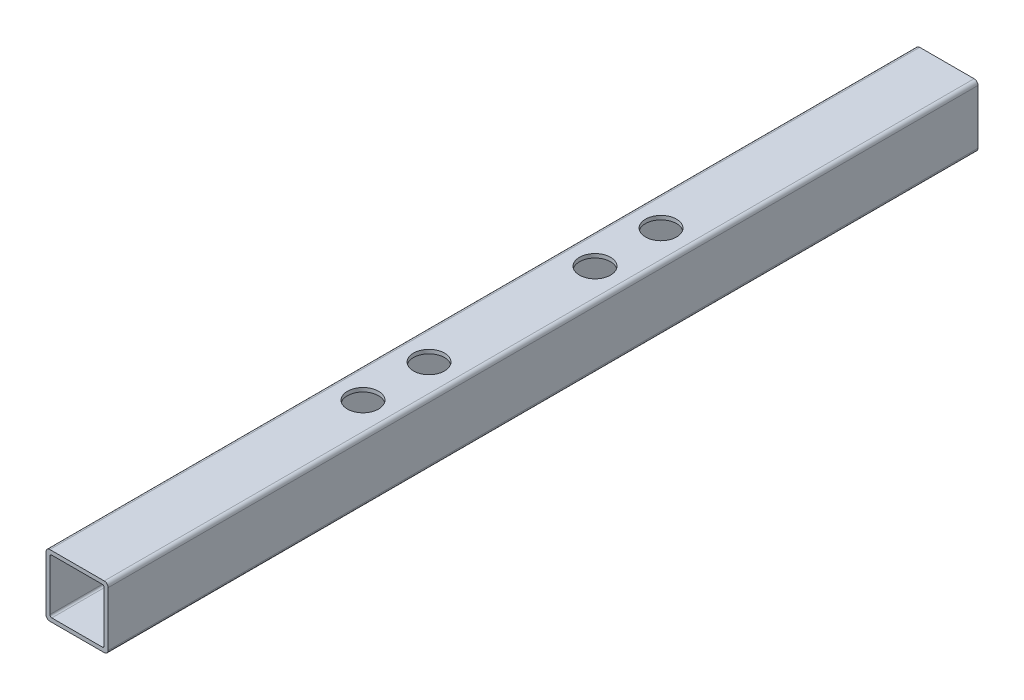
ISO-10303-21;
HEADER;
FILE_DESCRIPTION(('STEP AP214'),'2;1');
FILE_NAME('part.step','',(''),(''),'','','');
FILE_SCHEMA(('AUTOMOTIVE_DESIGN { 1 0 10303 214 1 1 1 1 }'));
ENDSEC;
DATA;
#1=APPLICATION_CONTEXT('core data for automotive mechanical design processes');
#2=APPLICATION_PROTOCOL_DEFINITION('international standard','automotive_design',2000,#1);
#3=PRODUCT_CONTEXT('',#1,'mechanical');
#4=PRODUCT('Part','Part','',(#3));
#5=PRODUCT_RELATED_PRODUCT_CATEGORY('part','',(#4));
#6=PRODUCT_DEFINITION_FORMATION('','',#4);
#7=PRODUCT_DEFINITION_CONTEXT('part definition',#1,'design');
#8=PRODUCT_DEFINITION('design','',#6,#7);
#9=PRODUCT_DEFINITION_SHAPE('','',#8);
#10=(LENGTH_UNIT() NAMED_UNIT(*) SI_UNIT(.MILLI.,.METRE.));
#11=(NAMED_UNIT(*) PLANE_ANGLE_UNIT() SI_UNIT($,.RADIAN.));
#12=(NAMED_UNIT(*) SI_UNIT($,.STERADIAN.) SOLID_ANGLE_UNIT());
#13=UNCERTAINTY_MEASURE_WITH_UNIT(LENGTH_MEASURE(1.E-05),#10,'distance_accuracy_value','');
#14=(GEOMETRIC_REPRESENTATION_CONTEXT(3) GLOBAL_UNCERTAINTY_ASSIGNED_CONTEXT((#13)) GLOBAL_UNIT_ASSIGNED_CONTEXT((#10,
#11,#12)) REPRESENTATION_CONTEXT('',''));
#15=CARTESIAN_POINT('',(0.,0.,0.));
#16=DIRECTION('',(0.,0.,1.));
#17=DIRECTION('',(1.,0.,0.));
#18=AXIS2_PLACEMENT_3D('',#15,#16,#17);
#19=CARTESIAN_POINT('',(-22.225,-22.225,355.6));
#20=DIRECTION('',(0.,0.,1.));
#21=DIRECTION('',(1.,0.,0.));
#22=AXIS2_PLACEMENT_3D('',#19,#20,#21);
#23=PLANE('',#22);
#24=CARTESIAN_POINT('',(-22.225,-22.225,355.6));
#25=DIRECTION('',(0.,0.,1.));
#26=DIRECTION('',(1.,0.,0.));
#27=AXIS2_PLACEMENT_3D('',#24,#25,#26);
#28=CIRCLE('',#27,3.175);
#29=CARTESIAN_POINT('',(-25.4,-22.225,355.6));
#30=VERTEX_POINT('',#29);
#31=CARTESIAN_POINT('',(-22.225,-25.4,355.6));
#32=VERTEX_POINT('',#31);
#33=EDGE_CURVE('E215',#30,#32,#28,.T.);
#34=ORIENTED_EDGE('',*,*,#33,.T.);
#35=DIRECTION('',(1.,0.,0.));
#36=VECTOR('',#35,1.);
#37=CARTESIAN_POINT('',(-22.225,-25.4,355.6));
#38=LINE('',#37,#36);
#39=CARTESIAN_POINT('',(22.225,-25.4,355.6));
#40=VERTEX_POINT('',#39);
#41=EDGE_CURVE('E218',#32,#40,#38,.T.);
#42=ORIENTED_EDGE('',*,*,#41,.T.);
#43=CARTESIAN_POINT('',(22.225,-22.225,355.6));
#44=DIRECTION('',(0.,0.,1.));
#45=DIRECTION('',(1.,0.,0.));
#46=AXIS2_PLACEMENT_3D('',#43,#44,#45);
#47=CIRCLE('',#46,3.175);
#48=CARTESIAN_POINT('',(25.4,-22.225,355.6));
#49=VERTEX_POINT('',#48);
#50=EDGE_CURVE('E221',#40,#49,#47,.T.);
#51=ORIENTED_EDGE('',*,*,#50,.T.);
#52=DIRECTION('',(0.,1.,0.));
#53=VECTOR('',#52,1.);
#54=CARTESIAN_POINT('',(25.4,22.225,355.6));
#55=LINE('',#54,#53);
#56=CARTESIAN_POINT('',(25.4,22.225,355.6));
#57=VERTEX_POINT('',#56);
#58=EDGE_CURVE('E223',#49,#57,#55,.T.);
#59=ORIENTED_EDGE('',*,*,#58,.T.);
#60=CARTESIAN_POINT('',(22.225,22.225,355.6));
#61=DIRECTION('',(0.,0.,1.));
#62=DIRECTION('',(-1.,0.,0.));
#63=AXIS2_PLACEMENT_3D('',#60,#61,#62);
#64=CIRCLE('',#63,3.175);
#65=CARTESIAN_POINT('',(22.225,25.4,355.6));
#66=VERTEX_POINT('',#65);
#67=EDGE_CURVE('E225',#57,#66,#64,.T.);
#68=ORIENTED_EDGE('',*,*,#67,.T.);
#69=DIRECTION('',(-1.,0.,0.));
#70=VECTOR('',#69,1.);
#71=CARTESIAN_POINT('',(-22.225,25.4,355.6));
#72=LINE('',#71,#70);
#73=CARTESIAN_POINT('',(-22.225,25.4,355.6));
#74=VERTEX_POINT('',#73);
#75=EDGE_CURVE('E227',#66,#74,#72,.T.);
#76=ORIENTED_EDGE('',*,*,#75,.T.);
#77=CARTESIAN_POINT('',(-22.225,22.225,355.6));
#78=DIRECTION('',(0.,0.,1.));
#79=DIRECTION('',(1.,0.,0.));
#80=AXIS2_PLACEMENT_3D('',#77,#78,#79);
#81=CIRCLE('',#80,3.175);
#82=CARTESIAN_POINT('',(-25.4,22.225,355.6));
#83=VERTEX_POINT('',#82);
#84=EDGE_CURVE('E229',#74,#83,#81,.T.);
#85=ORIENTED_EDGE('',*,*,#84,.T.);
#86=DIRECTION('',(0.,-1.,0.));
#87=VECTOR('',#86,1.);
#88=CARTESIAN_POINT('',(-25.4,22.225,355.6));
#89=LINE('',#88,#87);
#90=EDGE_CURVE('E231',#83,#30,#89,.T.);
#91=ORIENTED_EDGE('',*,*,#90,.T.);
#92=EDGE_LOOP('',(#34,#42,#51,#59,#68,#76,#85,#91));
#93=FACE_BOUND('',#92,.T.);
#94=DIRECTION('',(0.,-1.,0.));
#95=VECTOR('',#94,1.);
#96=CARTESIAN_POINT('',(-22.225,20.6375,355.6));
#97=LINE('',#96,#95);
#98=CARTESIAN_POINT('',(-22.225,20.6375,355.6));
#99=VERTEX_POINT('',#98);
#100=CARTESIAN_POINT('',(-22.225,-20.6375,355.6));
#101=VERTEX_POINT('',#100);
#102=EDGE_CURVE('E156',#99,#101,#97,.T.);
#103=ORIENTED_EDGE('',*,*,#102,.F.);
#104=CARTESIAN_POINT('',(-20.6375,20.6375,355.6));
#105=DIRECTION('',(0.,0.,1.));
#106=DIRECTION('',(1.,0.,0.));
#107=AXIS2_PLACEMENT_3D('',#104,#105,#106);
#108=CIRCLE('',#107,1.5875);
#109=CARTESIAN_POINT('',(-20.6375,22.225,355.6));
#110=VERTEX_POINT('',#109);
#111=EDGE_CURVE('E148',#110,#99,#108,.T.);
#112=ORIENTED_EDGE('',*,*,#111,.F.);
#113=DIRECTION('',(-1.,0.,0.));
#114=VECTOR('',#113,1.);
#115=CARTESIAN_POINT('',(-20.6375,22.225,355.6));
#116=LINE('',#115,#114);
#117=CARTESIAN_POINT('',(20.6375,22.225,355.6));
#118=VERTEX_POINT('',#117);
#119=EDGE_CURVE('E182',#118,#110,#116,.T.);
#120=ORIENTED_EDGE('',*,*,#119,.F.);
#121=CARTESIAN_POINT('',(20.6375,20.6375,355.6));
#122=DIRECTION('',(0.,0.,1.));
#123=DIRECTION('',(-1.,0.,0.));
#124=AXIS2_PLACEMENT_3D('',#121,#122,#123);
#125=CIRCLE('',#124,1.5875);
#126=CARTESIAN_POINT('',(22.225,20.6375,355.6));
#127=VERTEX_POINT('',#126);
#128=EDGE_CURVE('E180',#127,#118,#125,.T.);
#129=ORIENTED_EDGE('',*,*,#128,.F.);
#130=DIRECTION('',(0.,1.,0.));
#131=VECTOR('',#130,1.);
#132=CARTESIAN_POINT('',(22.225,20.6375,355.6));
#133=LINE('',#132,#131);
#134=CARTESIAN_POINT('',(22.225,-20.6375,355.6));
#135=VERTEX_POINT('',#134);
#136=EDGE_CURVE('E178',#135,#127,#133,.T.);
#137=ORIENTED_EDGE('',*,*,#136,.F.);
#138=CARTESIAN_POINT('',(20.6375,-20.6375,355.6));
#139=DIRECTION('',(0.,0.,1.));
#140=DIRECTION('',(1.,0.,0.));
#141=AXIS2_PLACEMENT_3D('',#138,#139,#140);
#142=CIRCLE('',#141,1.5875);
#143=CARTESIAN_POINT('',(20.6375,-22.225,355.6));
#144=VERTEX_POINT('',#143);
#145=EDGE_CURVE('E176',#144,#135,#142,.T.);
#146=ORIENTED_EDGE('',*,*,#145,.F.);
#147=DIRECTION('',(1.,0.,0.));
#148=VECTOR('',#147,1.);
#149=CARTESIAN_POINT('',(-20.6375,-22.225,355.6));
#150=LINE('',#149,#148);
#151=CARTESIAN_POINT('',(-20.6375,-22.225,355.6));
#152=VERTEX_POINT('',#151);
#153=EDGE_CURVE('E171',#152,#144,#150,.T.);
#154=ORIENTED_EDGE('',*,*,#153,.F.);
#155=CARTESIAN_POINT('',(-20.6375,-20.6375,355.6));
#156=DIRECTION('',(0.,0.,1.));
#157=DIRECTION('',(1.,0.,0.));
#158=AXIS2_PLACEMENT_3D('',#155,#156,#157);
#159=CIRCLE('',#158,1.5875);
#160=EDGE_CURVE('E169',#101,#152,#159,.T.);
#161=ORIENTED_EDGE('',*,*,#160,.F.);
#162=EDGE_LOOP('',(#103,#112,#120,#129,#137,#146,#154,#161));
#163=FACE_BOUND('',#162,.T.);
#164=ADVANCED_FACE('F33',(#93,#163),#23,.T.);
#165=CARTESIAN_POINT('',(-22.225,-22.225,-355.6));
#166=DIRECTION('',(0.,0.,1.));
#167=DIRECTION('',(1.,0.,0.));
#168=AXIS2_PLACEMENT_3D('',#165,#166,#167);
#169=PLANE('',#168);
#170=CARTESIAN_POINT('',(-22.225,-22.225,-355.6));
#171=DIRECTION('',(0.,0.,1.));
#172=DIRECTION('',(1.,0.,0.));
#173=AXIS2_PLACEMENT_3D('',#170,#171,#172);
#174=CIRCLE('',#173,3.175);
#175=CARTESIAN_POINT('',(-25.4,-22.225,-355.6));
#176=VERTEX_POINT('',#175);
#177=CARTESIAN_POINT('',(-22.225,-25.4,-355.6));
#178=VERTEX_POINT('',#177);
#179=EDGE_CURVE('E164',#176,#178,#174,.T.);
#180=ORIENTED_EDGE('',*,*,#179,.F.);
#181=DIRECTION('',(0.,-1.,0.));
#182=VECTOR('',#181,1.);
#183=CARTESIAN_POINT('',(-25.4,22.225,-355.6));
#184=LINE('',#183,#182);
#185=CARTESIAN_POINT('',(-25.4,22.225,-355.6));
#186=VERTEX_POINT('',#185);
#187=EDGE_CURVE('E219',#186,#176,#184,.T.);
#188=ORIENTED_EDGE('',*,*,#187,.F.);
#189=CARTESIAN_POINT('',(-22.225,22.225,-355.6));
#190=DIRECTION('',(0.,0.,1.));
#191=DIRECTION('',(1.,0.,0.));
#192=AXIS2_PLACEMENT_3D('',#189,#190,#191);
#193=CIRCLE('',#192,3.175);
#194=CARTESIAN_POINT('',(-22.225,25.4,-355.6));
#195=VERTEX_POINT('',#194);
#196=EDGE_CURVE('E246',#195,#186,#193,.T.);
#197=ORIENTED_EDGE('',*,*,#196,.F.);
#198=DIRECTION('',(-1.,0.,0.));
#199=VECTOR('',#198,1.);
#200=CARTESIAN_POINT('',(-22.225,25.4,-355.6));
#201=LINE('',#200,#199);
#202=CARTESIAN_POINT('',(22.225,25.4,-355.6));
#203=VERTEX_POINT('',#202);
#204=EDGE_CURVE('E244',#203,#195,#201,.T.);
#205=ORIENTED_EDGE('',*,*,#204,.F.);
#206=CARTESIAN_POINT('',(22.225,22.225,-355.6));
#207=DIRECTION('',(0.,0.,1.));
#208=DIRECTION('',(-1.,0.,0.));
#209=AXIS2_PLACEMENT_3D('',#206,#207,#208);
#210=CIRCLE('',#209,3.175);
#211=CARTESIAN_POINT('',(25.4,22.225,-355.6));
#212=VERTEX_POINT('',#211);
#213=EDGE_CURVE('E242',#212,#203,#210,.T.);
#214=ORIENTED_EDGE('',*,*,#213,.F.);
#215=DIRECTION('',(0.,1.,0.));
#216=VECTOR('',#215,1.);
#217=CARTESIAN_POINT('',(25.4,22.225,-355.6));
#218=LINE('',#217,#216);
#219=CARTESIAN_POINT('',(25.4,-22.225,-355.6));
#220=VERTEX_POINT('',#219);
#221=EDGE_CURVE('E240',#220,#212,#218,.T.);
#222=ORIENTED_EDGE('',*,*,#221,.F.);
#223=CARTESIAN_POINT('',(22.225,-22.225,-355.6));
#224=DIRECTION('',(0.,0.,1.));
#225=DIRECTION('',(1.,0.,0.));
#226=AXIS2_PLACEMENT_3D('',#223,#224,#225);
#227=CIRCLE('',#226,3.175);
#228=CARTESIAN_POINT('',(22.225,-25.4,-355.6));
#229=VERTEX_POINT('',#228);
#230=EDGE_CURVE('E238',#229,#220,#227,.T.);
#231=ORIENTED_EDGE('',*,*,#230,.F.);
#232=DIRECTION('',(1.,0.,0.));
#233=VECTOR('',#232,1.);
#234=CARTESIAN_POINT('',(-22.225,-25.4,-355.6));
#235=LINE('',#234,#233);
#236=EDGE_CURVE('E236',#178,#229,#235,.T.);
#237=ORIENTED_EDGE('',*,*,#236,.F.);
#238=EDGE_LOOP('',(#180,#188,#197,#205,#214,#222,#231,#237));
#239=FACE_BOUND('',#238,.T.);
#240=CARTESIAN_POINT('',(-20.6375,20.6375,-355.6));
#241=DIRECTION('',(0.,0.,1.));
#242=DIRECTION('',(1.,0.,0.));
#243=AXIS2_PLACEMENT_3D('',#240,#241,#242);
#244=CIRCLE('',#243,1.5875);
#245=CARTESIAN_POINT('',(-20.6375,22.225,-355.6));
#246=VERTEX_POINT('',#245);
#247=CARTESIAN_POINT('',(-22.225,20.6375,-355.6));
#248=VERTEX_POINT('',#247);
#249=EDGE_CURVE('E58',#246,#248,#244,.T.);
#250=ORIENTED_EDGE('',*,*,#249,.T.);
#251=DIRECTION('',(0.,-1.,0.));
#252=VECTOR('',#251,1.);
#253=CARTESIAN_POINT('',(-22.225,20.6375,-355.6));
#254=LINE('',#253,#252);
#255=CARTESIAN_POINT('',(-22.225,-20.6375,-355.6));
#256=VERTEX_POINT('',#255);
#257=EDGE_CURVE('E163',#248,#256,#254,.T.);
#258=ORIENTED_EDGE('',*,*,#257,.T.);
#259=CARTESIAN_POINT('',(-20.6375,-20.6375,-355.6));
#260=DIRECTION('',(0.,0.,1.));
#261=DIRECTION('',(1.,0.,0.));
#262=AXIS2_PLACEMENT_3D('',#259,#260,#261);
#263=CIRCLE('',#262,1.5875);
#264=CARTESIAN_POINT('',(-20.6375,-22.225,-355.6));
#265=VERTEX_POINT('',#264);
#266=EDGE_CURVE('E187',#256,#265,#263,.T.);
#267=ORIENTED_EDGE('',*,*,#266,.T.);
#268=DIRECTION('',(1.,0.,0.));
#269=VECTOR('',#268,1.);
#270=CARTESIAN_POINT('',(-20.6375,-22.225,-355.6));
#271=LINE('',#270,#269);
#272=CARTESIAN_POINT('',(20.6375,-22.225,-355.6));
#273=VERTEX_POINT('',#272);
#274=EDGE_CURVE('E190',#265,#273,#271,.T.);
#275=ORIENTED_EDGE('',*,*,#274,.T.);
#276=CARTESIAN_POINT('',(20.6375,-20.6375,-355.6));
#277=DIRECTION('',(0.,0.,1.));
#278=DIRECTION('',(1.,0.,0.));
#279=AXIS2_PLACEMENT_3D('',#276,#277,#278);
#280=CIRCLE('',#279,1.5875);
#281=CARTESIAN_POINT('',(22.225,-20.6375,-355.6));
#282=VERTEX_POINT('',#281);
#283=EDGE_CURVE('E193',#273,#282,#280,.T.);
#284=ORIENTED_EDGE('',*,*,#283,.T.);
#285=DIRECTION('',(0.,1.,0.));
#286=VECTOR('',#285,1.);
#287=CARTESIAN_POINT('',(22.225,20.6375,-355.6));
#288=LINE('',#287,#286);
#289=CARTESIAN_POINT('',(22.225,20.6375,-355.6));
#290=VERTEX_POINT('',#289);
#291=EDGE_CURVE('E196',#282,#290,#288,.T.);
#292=ORIENTED_EDGE('',*,*,#291,.T.);
#293=CARTESIAN_POINT('',(20.6375,20.6375,-355.6));
#294=DIRECTION('',(0.,0.,1.));
#295=DIRECTION('',(-1.,0.,0.));
#296=AXIS2_PLACEMENT_3D('',#293,#294,#295);
#297=CIRCLE('',#296,1.5875);
#298=CARTESIAN_POINT('',(20.6375,22.225,-355.6));
#299=VERTEX_POINT('',#298);
#300=EDGE_CURVE('E199',#290,#299,#297,.T.);
#301=ORIENTED_EDGE('',*,*,#300,.T.);
#302=DIRECTION('',(-1.,0.,0.));
#303=VECTOR('',#302,1.);
#304=CARTESIAN_POINT('',(-20.6375,22.225,-355.6));
#305=LINE('',#304,#303);
#306=EDGE_CURVE('E157',#299,#246,#305,.T.);
#307=ORIENTED_EDGE('',*,*,#306,.T.);
#308=EDGE_LOOP('',(#250,#258,#267,#275,#284,#292,#301,#307));
#309=FACE_BOUND('',#308,.T.);
#310=ADVANCED_FACE('F324',(#239,#309),#169,.F.);
#311=CARTESIAN_POINT('',(-22.225,-22.225,355.6));
#312=DIRECTION('',(0.,0.,-1.));
#313=DIRECTION('',(-1.,0.,0.));
#314=AXIS2_PLACEMENT_3D('',#311,#312,#313);
#315=CYLINDRICAL_SURFACE('',#314,3.175);
#316=ORIENTED_EDGE('',*,*,#179,.T.);
#317=DIRECTION('',(0.,0.,-1.));
#318=VECTOR('',#317,1.);
#319=CARTESIAN_POINT('',(-22.225,-25.4,355.6));
#320=LINE('',#319,#318);
#321=EDGE_CURVE('E11',#32,#178,#320,.T.);
#322=ORIENTED_EDGE('',*,*,#321,.F.);
#323=ORIENTED_EDGE('',*,*,#33,.F.);
#324=DIRECTION('',(0.,0.,-1.));
#325=VECTOR('',#324,1.);
#326=CARTESIAN_POINT('',(-25.4,-22.225,355.6));
#327=LINE('',#326,#325);
#328=EDGE_CURVE('E233',#30,#176,#327,.T.);
#329=ORIENTED_EDGE('',*,*,#328,.T.);
#330=EDGE_LOOP('',(#316,#322,#323,#329));
#331=FACE_BOUND('',#330,.T.);
#332=ADVANCED_FACE('F35',(#331),#315,.T.);
#333=CARTESIAN_POINT('',(-22.225,-25.4,355.6));
#334=DIRECTION('',(0.,1.,0.));
#335=DIRECTION('',(0.,0.,1.));
#336=AXIS2_PLACEMENT_3D('',#333,#334,#335);
#337=PLANE('',#336);
#338=CARTESIAN_POINT('',(0.,-25.4,121.840625));
#339=DIRECTION('',(0.,1.,0.));
#340=DIRECTION('',(0.,0.,1.));
#341=AXIS2_PLACEMENT_3D('',#338,#339,#340);
#342=CIRCLE('',#341,12.7);
#343=CARTESIAN_POINT('',(0.,-25.4,134.540625));
#344=VERTEX_POINT('',#343);
#345=EDGE_CURVE('E374',#344,#344,#342,.T.);
#346=ORIENTED_EDGE('',*,*,#345,.T.);
#347=EDGE_LOOP('',(#346));
#348=FACE_BOUND('',#347,.T.);
#349=CARTESIAN_POINT('',(0.,-25.4,67.865625));
#350=DIRECTION('',(0.,1.,0.));
#351=DIRECTION('',(0.,0.,1.));
#352=AXIS2_PLACEMENT_3D('',#349,#350,#351);
#353=CIRCLE('',#352,12.7);
#354=CARTESIAN_POINT('',(0.,-25.4,80.565625));
#355=VERTEX_POINT('',#354);
#356=EDGE_CURVE('E279',#355,#355,#353,.T.);
#357=ORIENTED_EDGE('',*,*,#356,.T.);
#358=EDGE_LOOP('',(#357));
#359=FACE_BOUND('',#358,.T.);
#360=CARTESIAN_POINT('',(0.,-25.4,-67.865625));
#361=DIRECTION('',(0.,1.,0.));
#362=DIRECTION('',(0.,0.,1.));
#363=AXIS2_PLACEMENT_3D('',#360,#361,#362);
#364=CIRCLE('',#363,12.7);
#365=CARTESIAN_POINT('',(0.,-25.4,-55.165625));
#366=VERTEX_POINT('',#365);
#367=EDGE_CURVE('E275',#366,#366,#364,.T.);
#368=ORIENTED_EDGE('',*,*,#367,.T.);
#369=EDGE_LOOP('',(#368));
#370=FACE_BOUND('',#369,.T.);
#371=CARTESIAN_POINT('',(0.,-25.4,-121.840625));
#372=DIRECTION('',(0.,1.,0.));
#373=DIRECTION('',(0.,0.,1.));
#374=AXIS2_PLACEMENT_3D('',#371,#372,#373);
#375=CIRCLE('',#374,12.7);
#376=CARTESIAN_POINT('',(0.,-25.4,-109.140625));
#377=VERTEX_POINT('',#376);
#378=EDGE_CURVE('E271',#377,#377,#375,.T.);
#379=ORIENTED_EDGE('',*,*,#378,.T.);
#380=EDGE_LOOP('',(#379));
#381=FACE_BOUND('',#380,.T.);
#382=ORIENTED_EDGE('',*,*,#236,.T.);
#383=DIRECTION('',(0.,0.,-1.));
#384=VECTOR('',#383,1.);
#385=CARTESIAN_POINT('',(22.225,-25.4,355.6));
#386=LINE('',#385,#384);
#387=EDGE_CURVE('E42',#40,#229,#386,.T.);
#388=ORIENTED_EDGE('',*,*,#387,.F.);
#389=ORIENTED_EDGE('',*,*,#41,.F.);
#390=ORIENTED_EDGE('',*,*,#321,.T.);
#391=EDGE_LOOP('',(#382,#388,#389,#390));
#392=FACE_BOUND('',#391,.T.);
#393=ADVANCED_FACE('F364',(#348,#359,#370,#381,#392),#337,.F.);
#394=CARTESIAN_POINT('',(22.225,-22.225,355.6));
#395=DIRECTION('',(0.,0.,-1.));
#396=DIRECTION('',(-1.,0.,0.));
#397=AXIS2_PLACEMENT_3D('',#394,#395,#396);
#398=CYLINDRICAL_SURFACE('',#397,3.175);
#399=ORIENTED_EDGE('',*,*,#230,.T.);
#400=DIRECTION('',(0.,0.,-1.));
#401=VECTOR('',#400,1.);
#402=CARTESIAN_POINT('',(25.4,-22.225,355.6));
#403=LINE('',#402,#401);
#404=EDGE_CURVE('E263',#49,#220,#403,.T.);
#405=ORIENTED_EDGE('',*,*,#404,.F.);
#406=ORIENTED_EDGE('',*,*,#50,.F.);
#407=ORIENTED_EDGE('',*,*,#387,.T.);
#408=EDGE_LOOP('',(#399,#405,#406,#407));
#409=FACE_BOUND('',#408,.T.);
#410=ADVANCED_FACE('F361',(#409),#398,.T.);
#411=CARTESIAN_POINT('',(25.4,22.225,355.6));
#412=DIRECTION('',(-1.,0.,0.));
#413=DIRECTION('',(0.,-1.,0.));
#414=AXIS2_PLACEMENT_3D('',#411,#412,#413);
#415=PLANE('',#414);
#416=ORIENTED_EDGE('',*,*,#221,.T.);
#417=DIRECTION('',(0.,0.,-1.));
#418=VECTOR('',#417,1.);
#419=CARTESIAN_POINT('',(25.4,22.225,355.6));
#420=LINE('',#419,#418);
#421=EDGE_CURVE('E260',#57,#212,#420,.T.);
#422=ORIENTED_EDGE('',*,*,#421,.F.);
#423=ORIENTED_EDGE('',*,*,#58,.F.);
#424=ORIENTED_EDGE('',*,*,#404,.T.);
#425=EDGE_LOOP('',(#416,#422,#423,#424));
#426=FACE_BOUND('',#425,.T.);
#427=ADVANCED_FACE('F357',(#426),#415,.F.);
#428=CARTESIAN_POINT('',(22.225,22.225,355.6));
#429=DIRECTION('',(0.,0.,-1.));
#430=DIRECTION('',(-1.,0.,0.));
#431=AXIS2_PLACEMENT_3D('',#428,#429,#430);
#432=CYLINDRICAL_SURFACE('',#431,3.175);
#433=ORIENTED_EDGE('',*,*,#213,.T.);
#434=DIRECTION('',(0.,0.,-1.));
#435=VECTOR('',#434,1.);
#436=CARTESIAN_POINT('',(22.225,25.4,355.6));
#437=LINE('',#436,#435);
#438=EDGE_CURVE('E257',#66,#203,#437,.T.);
#439=ORIENTED_EDGE('',*,*,#438,.F.);
#440=ORIENTED_EDGE('',*,*,#67,.F.);
#441=ORIENTED_EDGE('',*,*,#421,.T.);
#442=EDGE_LOOP('',(#433,#439,#440,#441));
#443=FACE_BOUND('',#442,.T.);
#444=ADVANCED_FACE('F353',(#443),#432,.T.);
#445=CARTESIAN_POINT('',(-22.225,25.4,355.6));
#446=DIRECTION('',(0.,-1.,0.));
#447=DIRECTION('',(0.,0.,-1.));
#448=AXIS2_PLACEMENT_3D('',#445,#446,#447);
#449=PLANE('',#448);
#450=CARTESIAN_POINT('',(0.,25.4,121.840625));
#451=DIRECTION('',(0.,1.,0.));
#452=DIRECTION('',(0.,0.,1.));
#453=AXIS2_PLACEMENT_3D('',#450,#451,#452);
#454=CIRCLE('',#453,12.7);
#455=CARTESIAN_POINT('',(0.,25.4,134.540625));
#456=VERTEX_POINT('',#455);
#457=EDGE_CURVE('E519',#456,#456,#454,.T.);
#458=ORIENTED_EDGE('',*,*,#457,.F.);
#459=EDGE_LOOP('',(#458));
#460=FACE_BOUND('',#459,.T.);
#461=CARTESIAN_POINT('',(0.,25.4,67.865625));
#462=DIRECTION('',(0.,1.,0.));
#463=DIRECTION('',(0.,0.,1.));
#464=AXIS2_PLACEMENT_3D('',#461,#462,#463);
#465=CIRCLE('',#464,12.7);
#466=CARTESIAN_POINT('',(0.,25.4,80.565625));
#467=VERTEX_POINT('',#466);
#468=EDGE_CURVE('E286',#467,#467,#465,.T.);
#469=ORIENTED_EDGE('',*,*,#468,.F.);
#470=EDGE_LOOP('',(#469));
#471=FACE_BOUND('',#470,.T.);
#472=CARTESIAN_POINT('',(0.,25.4,-67.865625));
#473=DIRECTION('',(0.,1.,0.));
#474=DIRECTION('',(0.,0.,1.));
#475=AXIS2_PLACEMENT_3D('',#472,#473,#474);
#476=CIRCLE('',#475,12.7);
#477=CARTESIAN_POINT('',(0.,25.4,-55.165625));
#478=VERTEX_POINT('',#477);
#479=EDGE_CURVE('E283',#478,#478,#476,.T.);
#480=ORIENTED_EDGE('',*,*,#479,.F.);
#481=EDGE_LOOP('',(#480));
#482=FACE_BOUND('',#481,.T.);
#483=CARTESIAN_POINT('',(0.,25.4,-121.840625));
#484=DIRECTION('',(0.,1.,0.));
#485=DIRECTION('',(0.,0.,1.));
#486=AXIS2_PLACEMENT_3D('',#483,#484,#485);
#487=CIRCLE('',#486,12.7);
#488=CARTESIAN_POINT('',(0.,25.4,-109.140625));
#489=VERTEX_POINT('',#488);
#490=EDGE_CURVE('E301',#489,#489,#487,.T.);
#491=ORIENTED_EDGE('',*,*,#490,.F.);
#492=EDGE_LOOP('',(#491));
#493=FACE_BOUND('',#492,.T.);
#494=ORIENTED_EDGE('',*,*,#204,.T.);
#495=DIRECTION('',(0.,0.,-1.));
#496=VECTOR('',#495,1.);
#497=CARTESIAN_POINT('',(-22.225,25.4,355.6));
#498=LINE('',#497,#496);
#499=EDGE_CURVE('E254',#74,#195,#498,.T.);
#500=ORIENTED_EDGE('',*,*,#499,.F.);
#501=ORIENTED_EDGE('',*,*,#75,.F.);
#502=ORIENTED_EDGE('',*,*,#438,.T.);
#503=EDGE_LOOP('',(#494,#500,#501,#502));
#504=FACE_BOUND('',#503,.T.);
#505=ADVANCED_FACE('F349',(#460,#471,#482,#493,#504),#449,.F.);
#506=CARTESIAN_POINT('',(-22.225,22.225,355.6));
#507=DIRECTION('',(0.,0.,-1.));
#508=DIRECTION('',(-1.,0.,0.));
#509=AXIS2_PLACEMENT_3D('',#506,#507,#508);
#510=CYLINDRICAL_SURFACE('',#509,3.175);
#511=ORIENTED_EDGE('',*,*,#196,.T.);
#512=DIRECTION('',(0.,0.,-1.));
#513=VECTOR('',#512,1.);
#514=CARTESIAN_POINT('',(-25.4,22.225,355.6));
#515=LINE('',#514,#513);
#516=EDGE_CURVE('E251',#83,#186,#515,.T.);
#517=ORIENTED_EDGE('',*,*,#516,.F.);
#518=ORIENTED_EDGE('',*,*,#84,.F.);
#519=ORIENTED_EDGE('',*,*,#499,.T.);
#520=EDGE_LOOP('',(#511,#517,#518,#519));
#521=FACE_BOUND('',#520,.T.);
#522=ADVANCED_FACE('F345',(#521),#510,.T.);
#523=CARTESIAN_POINT('',(-25.4,22.225,355.6));
#524=DIRECTION('',(1.,0.,0.));
#525=DIRECTION('',(0.,1.,0.));
#526=AXIS2_PLACEMENT_3D('',#523,#524,#525);
#527=PLANE('',#526);
#528=ORIENTED_EDGE('',*,*,#187,.T.);
#529=ORIENTED_EDGE('',*,*,#328,.F.);
#530=ORIENTED_EDGE('',*,*,#90,.F.);
#531=ORIENTED_EDGE('',*,*,#516,.T.);
#532=EDGE_LOOP('',(#528,#529,#530,#531));
#533=FACE_BOUND('',#532,.T.);
#534=ADVANCED_FACE('F342',(#533),#527,.F.);
#535=CARTESIAN_POINT('',(-20.6375,20.6375,355.6));
#536=DIRECTION('',(0.,0.,-1.));
#537=DIRECTION('',(-1.,0.,0.));
#538=AXIS2_PLACEMENT_3D('',#535,#536,#537);
#539=CYLINDRICAL_SURFACE('',#538,1.5875);
#540=ORIENTED_EDGE('',*,*,#249,.F.);
#541=DIRECTION('',(0.,0.,-1.));
#542=VECTOR('',#541,1.);
#543=CARTESIAN_POINT('',(-20.6375,22.225,355.6));
#544=LINE('',#543,#542);
#545=EDGE_CURVE('E152',#110,#246,#544,.T.);
#546=ORIENTED_EDGE('',*,*,#545,.F.);
#547=ORIENTED_EDGE('',*,*,#111,.T.);
#548=DIRECTION('',(0.,0.,-1.));
#549=VECTOR('',#548,1.);
#550=CARTESIAN_POINT('',(-22.225,20.6375,355.6));
#551=LINE('',#550,#549);
#552=EDGE_CURVE('E151',#99,#248,#551,.T.);
#553=ORIENTED_EDGE('',*,*,#552,.T.);
#554=EDGE_LOOP('',(#540,#546,#547,#553));
#555=FACE_BOUND('',#554,.T.);
#556=ADVANCED_FACE('F150',(#555),#539,.F.);
#557=CARTESIAN_POINT('',(-22.225,20.6375,355.6));
#558=DIRECTION('',(1.,0.,0.));
#559=DIRECTION('',(0.,0.,-1.));
#560=AXIS2_PLACEMENT_3D('',#557,#558,#559);
#561=PLANE('',#560);
#562=ORIENTED_EDGE('',*,*,#257,.F.);
#563=ORIENTED_EDGE('',*,*,#552,.F.);
#564=ORIENTED_EDGE('',*,*,#102,.T.);
#565=DIRECTION('',(0.,0.,-1.));
#566=VECTOR('',#565,1.);
#567=CARTESIAN_POINT('',(-22.225,-20.6375,355.6));
#568=LINE('',#567,#566);
#569=EDGE_CURVE('E165',#101,#256,#568,.T.);
#570=ORIENTED_EDGE('',*,*,#569,.T.);
#571=EDGE_LOOP('',(#562,#563,#564,#570));
#572=FACE_BOUND('',#571,.T.);
#573=ADVANCED_FACE('F160',(#572),#561,.T.);
#574=CARTESIAN_POINT('',(-20.6375,-20.6375,355.6));
#575=DIRECTION('',(0.,0.,-1.));
#576=DIRECTION('',(-1.,0.,0.));
#577=AXIS2_PLACEMENT_3D('',#574,#575,#576);
#578=CYLINDRICAL_SURFACE('',#577,1.5875);
#579=ORIENTED_EDGE('',*,*,#266,.F.);
#580=ORIENTED_EDGE('',*,*,#569,.F.);
#581=ORIENTED_EDGE('',*,*,#160,.T.);
#582=DIRECTION('',(0.,0.,-1.));
#583=VECTOR('',#582,1.);
#584=CARTESIAN_POINT('',(-20.6375,-22.225,355.6));
#585=LINE('',#584,#583);
#586=EDGE_CURVE('E212',#152,#265,#585,.T.);
#587=ORIENTED_EDGE('',*,*,#586,.T.);
#588=EDGE_LOOP('',(#579,#580,#581,#587));
#589=FACE_BOUND('',#588,.T.);
#590=ADVANCED_FACE('F315',(#589),#578,.F.);
#591=CARTESIAN_POINT('',(-20.6375,-22.225,355.6));
#592=DIRECTION('',(0.,1.,0.));
#593=DIRECTION('',(0.,0.,1.));
#594=AXIS2_PLACEMENT_3D('',#591,#592,#593);
#595=PLANE('',#594);
#596=CARTESIAN_POINT('',(0.,-22.225,121.840625));
#597=DIRECTION('',(0.,1.,0.));
#598=DIRECTION('',(0.,0.,1.));
#599=AXIS2_PLACEMENT_3D('',#596,#597,#598);
#600=CIRCLE('',#599,12.7);
#601=CARTESIAN_POINT('',(0.,-22.225,134.540625));
#602=VERTEX_POINT('',#601);
#603=EDGE_CURVE('E291',#602,#602,#600,.T.);
#604=ORIENTED_EDGE('',*,*,#603,.F.);
#605=EDGE_LOOP('',(#604));
#606=FACE_BOUND('',#605,.T.);
#607=CARTESIAN_POINT('',(0.,-22.225,67.865625));
#608=DIRECTION('',(0.,1.,0.));
#609=DIRECTION('',(0.,0.,1.));
#610=AXIS2_PLACEMENT_3D('',#607,#608,#609);
#611=CIRCLE('',#610,12.7);
#612=CARTESIAN_POINT('',(0.,-22.225,80.565625));
#613=VERTEX_POINT('',#612);
#614=EDGE_CURVE('E278',#613,#613,#611,.T.);
#615=ORIENTED_EDGE('',*,*,#614,.F.);
#616=EDGE_LOOP('',(#615));
#617=FACE_BOUND('',#616,.T.);
#618=CARTESIAN_POINT('',(0.,-22.225,-67.865625));
#619=DIRECTION('',(0.,1.,0.));
#620=DIRECTION('',(0.,0.,1.));
#621=AXIS2_PLACEMENT_3D('',#618,#619,#620);
#622=CIRCLE('',#621,12.7);
#623=CARTESIAN_POINT('',(0.,-22.225,-55.165625));
#624=VERTEX_POINT('',#623);
#625=EDGE_CURVE('E274',#624,#624,#622,.T.);
#626=ORIENTED_EDGE('',*,*,#625,.F.);
#627=EDGE_LOOP('',(#626));
#628=FACE_BOUND('',#627,.T.);
#629=CARTESIAN_POINT('',(0.,-22.225,-121.840625));
#630=DIRECTION('',(0.,1.,0.));
#631=DIRECTION('',(0.,0.,1.));
#632=AXIS2_PLACEMENT_3D('',#629,#630,#631);
#633=CIRCLE('',#632,12.7);
#634=CARTESIAN_POINT('',(0.,-22.225,-109.140625));
#635=VERTEX_POINT('',#634);
#636=EDGE_CURVE('E185',#635,#635,#633,.T.);
#637=ORIENTED_EDGE('',*,*,#636,.F.);
#638=EDGE_LOOP('',(#637));
#639=FACE_BOUND('',#638,.T.);
#640=ORIENTED_EDGE('',*,*,#274,.F.);
#641=ORIENTED_EDGE('',*,*,#586,.F.);
#642=ORIENTED_EDGE('',*,*,#153,.T.);
#643=DIRECTION('',(0.,0.,-1.));
#644=VECTOR('',#643,1.);
#645=CARTESIAN_POINT('',(20.6375,-22.225,355.6));
#646=LINE('',#645,#644);
#647=EDGE_CURVE('E210',#144,#273,#646,.T.);
#648=ORIENTED_EDGE('',*,*,#647,.T.);
#649=EDGE_LOOP('',(#640,#641,#642,#648));
#650=FACE_BOUND('',#649,.T.);
#651=ADVANCED_FACE('F311',(#606,#617,#628,#639,#650),#595,.T.);
#652=CARTESIAN_POINT('',(20.6375,-20.6375,355.6));
#653=DIRECTION('',(0.,0.,-1.));
#654=DIRECTION('',(-1.,0.,0.));
#655=AXIS2_PLACEMENT_3D('',#652,#653,#654);
#656=CYLINDRICAL_SURFACE('',#655,1.5875);
#657=ORIENTED_EDGE('',*,*,#283,.F.);
#658=ORIENTED_EDGE('',*,*,#647,.F.);
#659=ORIENTED_EDGE('',*,*,#145,.T.);
#660=DIRECTION('',(0.,0.,-1.));
#661=VECTOR('',#660,1.);
#662=CARTESIAN_POINT('',(22.225,-20.6375,355.6));
#663=LINE('',#662,#661);
#664=EDGE_CURVE('E208',#135,#282,#663,.T.);
#665=ORIENTED_EDGE('',*,*,#664,.T.);
#666=EDGE_LOOP('',(#657,#658,#659,#665));
#667=FACE_BOUND('',#666,.T.);
#668=ADVANCED_FACE('F314',(#667),#656,.F.);
#669=CARTESIAN_POINT('',(22.225,20.6375,355.6));
#670=DIRECTION('',(-1.,0.,0.));
#671=DIRECTION('',(0.,-1.,0.));
#672=AXIS2_PLACEMENT_3D('',#669,#670,#671);
#673=PLANE('',#672);
#674=ORIENTED_EDGE('',*,*,#291,.F.);
#675=ORIENTED_EDGE('',*,*,#664,.F.);
#676=ORIENTED_EDGE('',*,*,#136,.T.);
#677=DIRECTION('',(0.,0.,-1.));
#678=VECTOR('',#677,1.);
#679=CARTESIAN_POINT('',(22.225,20.6375,355.6));
#680=LINE('',#679,#678);
#681=EDGE_CURVE('E206',#127,#290,#680,.T.);
#682=ORIENTED_EDGE('',*,*,#681,.T.);
#683=EDGE_LOOP('',(#674,#675,#676,#682));
#684=FACE_BOUND('',#683,.T.);
#685=ADVANCED_FACE('F424',(#684),#673,.T.);
#686=CARTESIAN_POINT('',(20.6375,20.6375,355.6));
#687=DIRECTION('',(0.,0.,-1.));
#688=DIRECTION('',(-1.,0.,0.));
#689=AXIS2_PLACEMENT_3D('',#686,#687,#688);
#690=CYLINDRICAL_SURFACE('',#689,1.5875);
#691=ORIENTED_EDGE('',*,*,#300,.F.);
#692=ORIENTED_EDGE('',*,*,#681,.F.);
#693=ORIENTED_EDGE('',*,*,#128,.T.);
#694=DIRECTION('',(0.,0.,-1.));
#695=VECTOR('',#694,1.);
#696=CARTESIAN_POINT('',(20.6375,22.225,355.6));
#697=LINE('',#696,#695);
#698=EDGE_CURVE('E50',#118,#299,#697,.T.);
#699=ORIENTED_EDGE('',*,*,#698,.T.);
#700=EDGE_LOOP('',(#691,#692,#693,#699));
#701=FACE_BOUND('',#700,.T.);
#702=ADVANCED_FACE('F420',(#701),#690,.F.);
#703=CARTESIAN_POINT('',(-20.6375,22.225,355.6));
#704=DIRECTION('',(0.,-1.,0.));
#705=DIRECTION('',(0.,0.,-1.));
#706=AXIS2_PLACEMENT_3D('',#703,#704,#705);
#707=PLANE('',#706);
#708=CARTESIAN_POINT('',(0.,22.225,121.840625));
#709=DIRECTION('',(0.,-1.,0.));
#710=DIRECTION('',(0.,0.,-1.));
#711=AXIS2_PLACEMENT_3D('',#708,#709,#710);
#712=CIRCLE('',#711,12.7);
#713=CARTESIAN_POINT('',(0.,22.225,109.140625));
#714=VERTEX_POINT('',#713);
#715=EDGE_CURVE('E37',#714,#714,#712,.T.);
#716=ORIENTED_EDGE('',*,*,#715,.F.);
#717=EDGE_LOOP('',(#716));
#718=FACE_BOUND('',#717,.T.);
#719=CARTESIAN_POINT('',(0.,22.225,67.865625));
#720=DIRECTION('',(0.,-1.,0.));
#721=DIRECTION('',(0.,0.,-1.));
#722=AXIS2_PLACEMENT_3D('',#719,#720,#721);
#723=CIRCLE('',#722,12.7);
#724=CARTESIAN_POINT('',(0.,22.225,55.165625));
#725=VERTEX_POINT('',#724);
#726=EDGE_CURVE('E276',#725,#725,#723,.T.);
#727=ORIENTED_EDGE('',*,*,#726,.F.);
#728=EDGE_LOOP('',(#727));
#729=FACE_BOUND('',#728,.T.);
#730=CARTESIAN_POINT('',(0.,22.225,-67.865625));
#731=DIRECTION('',(0.,-1.,0.));
#732=DIRECTION('',(0.,0.,-1.));
#733=AXIS2_PLACEMENT_3D('',#730,#731,#732);
#734=CIRCLE('',#733,12.7);
#735=CARTESIAN_POINT('',(0.,22.225,-80.565625));
#736=VERTEX_POINT('',#735);
#737=EDGE_CURVE('E272',#736,#736,#734,.T.);
#738=ORIENTED_EDGE('',*,*,#737,.F.);
#739=EDGE_LOOP('',(#738));
#740=FACE_BOUND('',#739,.T.);
#741=CARTESIAN_POINT('',(0.,22.225,-121.840625));
#742=DIRECTION('',(0.,-1.,0.));
#743=DIRECTION('',(0.,0.,-1.));
#744=AXIS2_PLACEMENT_3D('',#741,#742,#743);
#745=CIRCLE('',#744,12.7);
#746=CARTESIAN_POINT('',(0.,22.225,-134.540625));
#747=VERTEX_POINT('',#746);
#748=EDGE_CURVE('E268',#747,#747,#745,.T.);
#749=ORIENTED_EDGE('',*,*,#748,.F.);
#750=EDGE_LOOP('',(#749));
#751=FACE_BOUND('',#750,.T.);
#752=ORIENTED_EDGE('',*,*,#306,.F.);
#753=ORIENTED_EDGE('',*,*,#698,.F.);
#754=ORIENTED_EDGE('',*,*,#119,.T.);
#755=ORIENTED_EDGE('',*,*,#545,.T.);
#756=EDGE_LOOP('',(#752,#753,#754,#755));
#757=FACE_BOUND('',#756,.T.);
#758=ADVANCED_FACE('F414',(#718,#729,#740,#751,#757),#707,.T.);
#759=CARTESIAN_POINT('',(0.,25.4,-121.840625));
#760=DIRECTION('',(0.,1.,0.));
#761=DIRECTION('',(0.,0.,1.));
#762=AXIS2_PLACEMENT_3D('',#759,#760,#761);
#763=CYLINDRICAL_SURFACE('',#762,12.7);
#764=ORIENTED_EDGE('',*,*,#748,.T.);
#765=EDGE_LOOP('',(#764));
#766=FACE_BOUND('',#765,.T.);
#767=ORIENTED_EDGE('',*,*,#490,.T.);
#768=EDGE_LOOP('',(#767));
#769=FACE_BOUND('',#768,.T.);
#770=ADVANCED_FACE('F405',(#766,#769),#763,.F.);
#771=ORIENTED_EDGE('',*,*,#636,.T.);
#772=EDGE_LOOP('',(#771));
#773=FACE_BOUND('',#772,.T.);
#774=ORIENTED_EDGE('',*,*,#378,.F.);
#775=EDGE_LOOP('',(#774));
#776=FACE_BOUND('',#775,.T.);
#777=ADVANCED_FACE('F308',(#773,#776),#763,.F.);
#778=CARTESIAN_POINT('',(0.,25.4,-67.865625));
#779=DIRECTION('',(0.,1.,0.));
#780=DIRECTION('',(0.,0.,1.));
#781=AXIS2_PLACEMENT_3D('',#778,#779,#780);
#782=CYLINDRICAL_SURFACE('',#781,12.7);
#783=ORIENTED_EDGE('',*,*,#737,.T.);
#784=EDGE_LOOP('',(#783));
#785=FACE_BOUND('',#784,.T.);
#786=ORIENTED_EDGE('',*,*,#479,.T.);
#787=EDGE_LOOP('',(#786));
#788=FACE_BOUND('',#787,.T.);
#789=ADVANCED_FACE('F404',(#785,#788),#782,.F.);
#790=ORIENTED_EDGE('',*,*,#625,.T.);
#791=EDGE_LOOP('',(#790));
#792=FACE_BOUND('',#791,.T.);
#793=ORIENTED_EDGE('',*,*,#367,.F.);
#794=EDGE_LOOP('',(#793));
#795=FACE_BOUND('',#794,.T.);
#796=ADVANCED_FACE('F411',(#792,#795),#782,.F.);
#797=CARTESIAN_POINT('',(0.,25.4,67.865625));
#798=DIRECTION('',(0.,1.,0.));
#799=DIRECTION('',(0.,0.,1.));
#800=AXIS2_PLACEMENT_3D('',#797,#798,#799);
#801=CYLINDRICAL_SURFACE('',#800,12.7);
#802=ORIENTED_EDGE('',*,*,#726,.T.);
#803=EDGE_LOOP('',(#802));
#804=FACE_BOUND('',#803,.T.);
#805=ORIENTED_EDGE('',*,*,#468,.T.);
#806=EDGE_LOOP('',(#805));
#807=FACE_BOUND('',#806,.T.);
#808=ADVANCED_FACE('F477',(#804,#807),#801,.F.);
#809=ORIENTED_EDGE('',*,*,#614,.T.);
#810=EDGE_LOOP('',(#809));
#811=FACE_BOUND('',#810,.T.);
#812=ORIENTED_EDGE('',*,*,#356,.F.);
#813=EDGE_LOOP('',(#812));
#814=FACE_BOUND('',#813,.T.);
#815=ADVANCED_FACE('F486',(#811,#814),#801,.F.);
#816=CARTESIAN_POINT('',(0.,25.4,121.840625));
#817=DIRECTION('',(0.,1.,0.));
#818=DIRECTION('',(0.,0.,1.));
#819=AXIS2_PLACEMENT_3D('',#816,#817,#818);
#820=CYLINDRICAL_SURFACE('',#819,12.7);
#821=ORIENTED_EDGE('',*,*,#715,.T.);
#822=EDGE_LOOP('',(#821));
#823=FACE_BOUND('',#822,.T.);
#824=ORIENTED_EDGE('',*,*,#457,.T.);
#825=EDGE_LOOP('',(#824));
#826=FACE_BOUND('',#825,.T.);
#827=ADVANCED_FACE('F494',(#823,#826),#820,.F.);
#828=ORIENTED_EDGE('',*,*,#603,.T.);
#829=EDGE_LOOP('',(#828));
#830=FACE_BOUND('',#829,.T.);
#831=ORIENTED_EDGE('',*,*,#345,.F.);
#832=EDGE_LOOP('',(#831));
#833=FACE_BOUND('',#832,.T.);
#834=ADVANCED_FACE('F503',(#830,#833),#820,.F.);
#835=CLOSED_SHELL('',(#164,#310,#332,#393,#410,#427,#444,#505,#522,#534,#556,#573,#590,#651,
#668,#685,#702,#758,#770,#777,#789,#796,#808,#815,#827,#834));
#836=MANIFOLD_SOLID_BREP('B2',#835);
#837=ADVANCED_BREP_SHAPE_REPRESENTATION('',(#18,#836),#14);
#838=SHAPE_DEFINITION_REPRESENTATION(#9,#837);
ENDSEC;
END-ISO-10303-21;
